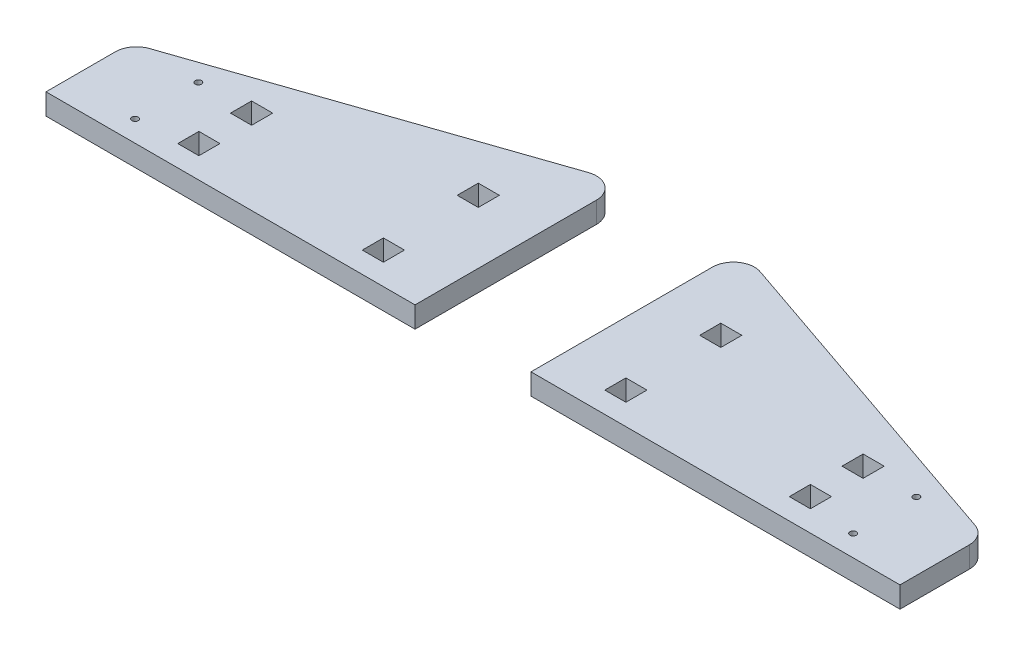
from build123d import *

# Parameters (mm, degrees)
BOSS_EXTRUDE1_DEPTH = 20
SKETCH2_R           = 3
SKETCH2_W           = 20
SKETCH2_H           = 20
CUT_EXTRUDE2_DEPTH  = 453.133829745
FILLET1_R           = 20


with BuildPart() as part:
    # Sketch1 → Boss-Extrude1 (new body)
    with BuildSketch(Plane(origin=(0, 0, 0), x_dir=(1, 0, 0), z_dir=(0, 1, 0))):
        Polygon((55, 0), (405, 0), (405, 80), (55, 200), align=None)
    extrude(amount=BOSS_EXTRUDE1_DEPTH)

    # Sketch2 → Cut-Extrude2 (cut, through all)
    with BuildSketch(Plane(origin=(0, 0, 0), x_dir=(1, 0, 0), z_dir=(0, 1, 0))):
        with Locations(Location((340.525, 20, 0), (0, 0, 270))):
            Circle(SKETCH2_R)
        with Locations(Location((340.525, 80, 0), (0, 0, 270))):
            Circle(SKETCH2_R)
        with Locations((115, 120)):
            Rectangle(SKETCH2_W, SKETCH2_H)
        with Locations((115, 30)):
            Rectangle(SKETCH2_W, SKETCH2_H)
        with Locations((290, 80)):
            Rectangle(SKETCH2_W, SKETCH2_H)
        with Locations((290, 30)):
            Rectangle(SKETCH2_W, SKETCH2_H)
    extrude(amount=CUT_EXTRUDE2_DEPTH, mode=Mode.SUBTRACT)

    # Fillet1
    fillet1_edges = [part.edges().sort_by_distance(p)[0] for p in [
        (55, 10, -200),
        (405, 10, -80),
    ]]
    fillet(fillet1_edges, radius=FILLET1_R)


with BuildPart() as body_2:
    # Mirror5: mirrored copy
    add(part.part.mirror(Plane(origin=(0, 0, 0), x_dir=(0, 0, 1), z_dir=(1, 0, 0))))


solid = Compound([part.part, body_2.part])
